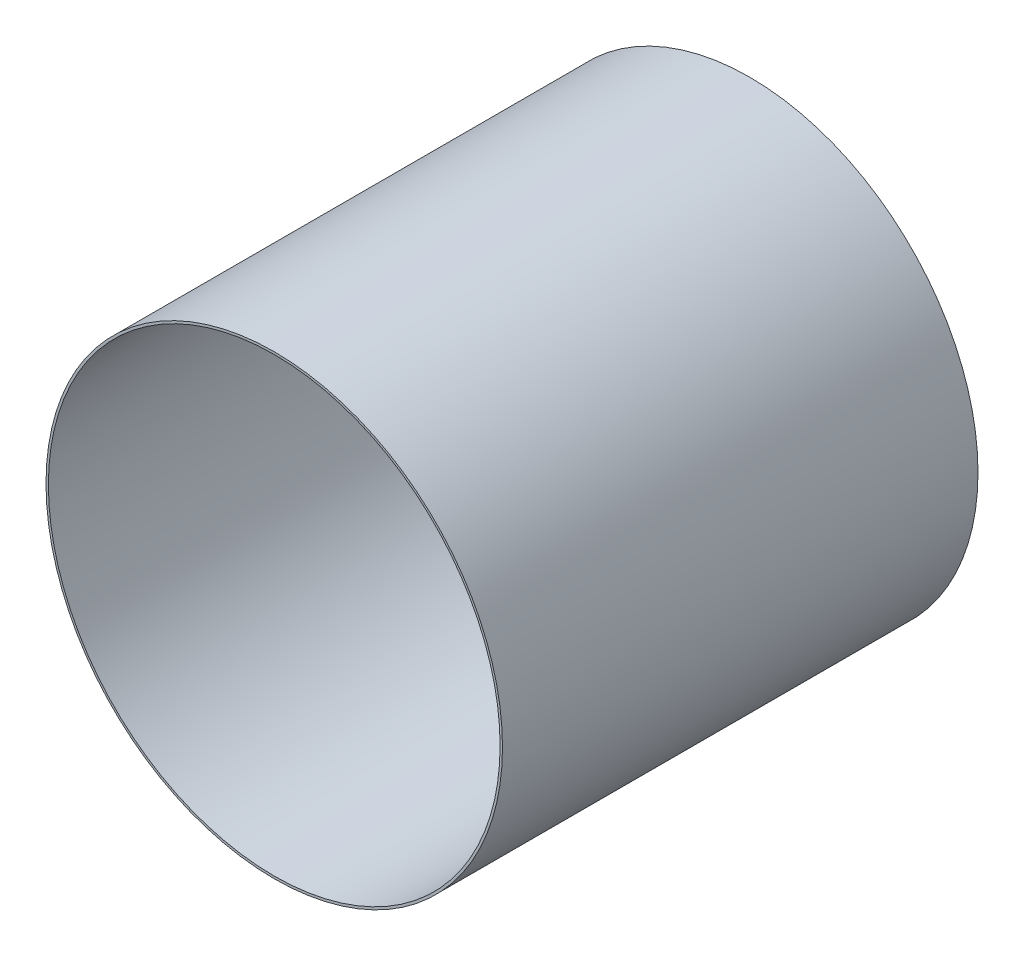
from build123d import *

# Parameters (mm, degrees)
SKETCH1_R           = 19.2
SKETCH1_R_2         = 19
BOSS_EXTRUDE1_DEPTH = 40


with BuildPart() as part:
    # Sketch1 → Boss-Extrude1 (new body)
    with BuildSketch(Plane.XY):
        Circle(SKETCH1_R)
        Circle(SKETCH1_R_2, mode=Mode.SUBTRACT)
    extrude(amount=-BOSS_EXTRUDE1_DEPTH)


solid = part.part
